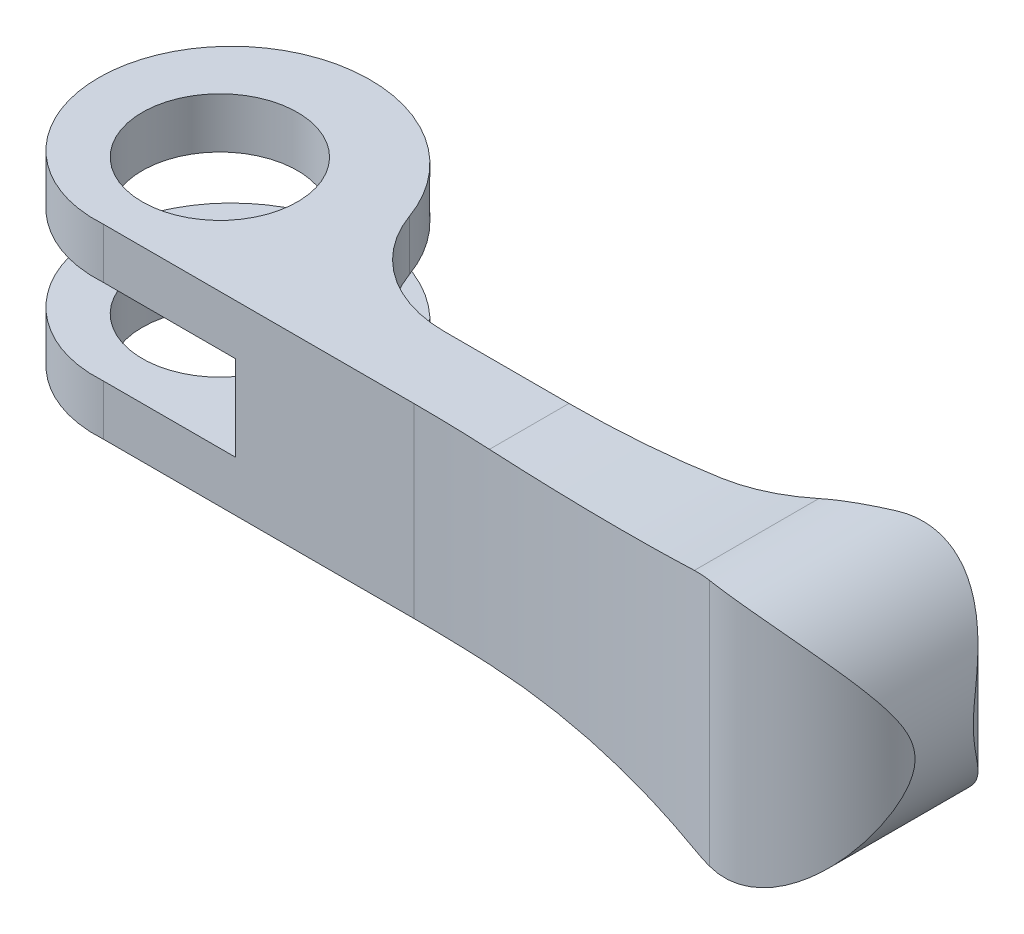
ISO-10303-21;
HEADER;
FILE_DESCRIPTION(('STEP AP214'),'2;1');
FILE_NAME('part.step','',(''),(''),'','','');
FILE_SCHEMA(('AUTOMOTIVE_DESIGN { 1 0 10303 214 1 1 1 1 }'));
ENDSEC;
DATA;
#1=APPLICATION_CONTEXT('core data for automotive mechanical design processes');
#2=APPLICATION_PROTOCOL_DEFINITION('international standard','automotive_design',2000,#1);
#3=PRODUCT_CONTEXT('',#1,'mechanical');
#4=PRODUCT('Part','Part','',(#3));
#5=PRODUCT_RELATED_PRODUCT_CATEGORY('part','',(#4));
#6=PRODUCT_DEFINITION_FORMATION('','',#4);
#7=PRODUCT_DEFINITION_CONTEXT('part definition',#1,'design');
#8=PRODUCT_DEFINITION('design','',#6,#7);
#9=PRODUCT_DEFINITION_SHAPE('','',#8);
#10=(LENGTH_UNIT() NAMED_UNIT(*) SI_UNIT(.MILLI.,.METRE.));
#11=(NAMED_UNIT(*) PLANE_ANGLE_UNIT() SI_UNIT($,.RADIAN.));
#12=(NAMED_UNIT(*) SI_UNIT($,.STERADIAN.) SOLID_ANGLE_UNIT());
#13=UNCERTAINTY_MEASURE_WITH_UNIT(LENGTH_MEASURE(1.E-05),#10,'distance_accuracy_value','');
#14=(GEOMETRIC_REPRESENTATION_CONTEXT(3) GLOBAL_UNCERTAINTY_ASSIGNED_CONTEXT((#13)) GLOBAL_UNIT_ASSIGNED_CONTEXT((#10,
#11,#12)) REPRESENTATION_CONTEXT('',''));
#15=CARTESIAN_POINT('',(0.,0.,0.));
#16=DIRECTION('',(0.,0.,1.));
#17=DIRECTION('',(1.,0.,0.));
#18=AXIS2_PLACEMENT_3D('',#15,#16,#17);
#19=CARTESIAN_POINT('',(46.0000000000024,-8.00000000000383,3.5000000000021));
#20=DIRECTION('',(0.,1.,0.));
#21=DIRECTION('',(1.,0.,0.));
#22=AXIS2_PLACEMENT_3D('',#19,#20,#21);
#23=CYLINDRICAL_SURFACE('',#22,4.5);
#24=DIRECTION('',(0.,1.,0.));
#25=VECTOR('',#24,1.);
#26=CARTESIAN_POINT('',(43.4276734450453,-8.00000000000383,-0.192307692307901));
#27=LINE('',#26,#25);
#28=CARTESIAN_POINT('',(43.4276734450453,-7.87157852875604,-0.192307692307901));
#29=VERTEX_POINT('',#28);
#30=CARTESIAN_POINT('',(43.4276734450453,7.87157852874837,-0.192307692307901));
#31=VERTEX_POINT('',#30);
#32=EDGE_CURVE('E306',#29,#31,#27,.T.);
#33=ORIENTED_EDGE('',*,*,#32,.T.);
#34=CARTESIAN_POINT('',(43.4276734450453,7.87157852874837,-0.192307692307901));
#35=CARTESIAN_POINT('',(43.523258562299,7.85425856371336,-0.258928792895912));
#36=CARTESIAN_POINT('',(43.6211842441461,7.83468392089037,-0.321607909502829));
#37=CARTESIAN_POINT('',(43.8207460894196,7.79071577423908,-0.438804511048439));
#38=CARTESIAN_POINT('',(43.9223816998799,7.76632298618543,-0.493323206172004));
#39=CARTESIAN_POINT('',(44.1279526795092,7.71252682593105,-0.59371219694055));
#40=CARTESIAN_POINT('',(44.2318754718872,7.68314677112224,-0.639620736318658));
#41=CARTESIAN_POINT('',(44.4414685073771,7.61913593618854,-0.722996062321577));
#42=CARTESIAN_POINT('',(44.547138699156,7.58450531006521,-0.760463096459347));
#43=CARTESIAN_POINT('',(44.7592373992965,7.5099430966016,-0.826992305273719));
#44=CARTESIAN_POINT('',(44.8656658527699,7.47001188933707,-0.856055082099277));
#45=CARTESIAN_POINT('',(45.0783878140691,7.3848938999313,-0.905970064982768));
#46=CARTESIAN_POINT('',(45.1846812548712,7.33970511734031,-0.926819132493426));
#47=CARTESIAN_POINT('',(45.3962371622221,7.24424197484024,-0.960599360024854));
#48=CARTESIAN_POINT('',(45.5014995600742,7.19396727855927,-0.973529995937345));
#49=CARTESIAN_POINT('',(45.7102658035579,7.08855491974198,-0.99188612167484));
#50=CARTESIAN_POINT('',(45.8137689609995,7.03341540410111,-0.997308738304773));
#51=CARTESIAN_POINT('',(46.0228790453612,6.91602811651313,-1.00120983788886));
#52=CARTESIAN_POINT('',(46.1283757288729,6.85357356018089,-0.999369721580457));
#53=CARTESIAN_POINT('',(46.3361454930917,6.72405069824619,-0.988634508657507));
#54=CARTESIAN_POINT('',(46.4384173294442,6.65698064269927,-0.979736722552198));
#55=CARTESIAN_POINT('',(46.7397120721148,6.44937990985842,-0.943391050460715));
#56=CARTESIAN_POINT('',(46.9332590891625,6.30243340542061,-0.906291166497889));
#57=CARTESIAN_POINT('',(47.2636061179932,6.02746951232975,-0.821561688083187));
#58=CARTESIAN_POINT('',(47.4037056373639,5.90209818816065,-0.777864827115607));
#59=CARTESIAN_POINT('',(47.6729193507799,5.64382658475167,-0.679935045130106));
#60=CARTESIAN_POINT('',(47.8020283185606,5.51092277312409,-0.625697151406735));
#61=CARTESIAN_POINT('',(48.1730975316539,5.10182618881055,-0.450019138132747));
#62=CARTESIAN_POINT('',(48.3982631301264,4.8157011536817,-0.315767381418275));
#63=CARTESIAN_POINT('',(48.7387591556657,4.31840281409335,-0.0745883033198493));
#64=CARTESIAN_POINT('',(48.8661331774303,4.11269079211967,0.0272560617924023));
#65=CARTESIAN_POINT('',(49.1011367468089,3.69213917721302,0.235408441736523));
#66=CARTESIAN_POINT('',(49.2087515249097,3.47729290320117,0.341719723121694));
#67=CARTESIAN_POINT('',(49.4043745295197,3.03857594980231,0.553645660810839));
#68=CARTESIAN_POINT('',(49.4923858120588,2.81470668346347,0.65926042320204));
#69=CARTESIAN_POINT('',(49.6486711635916,2.35717822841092,0.863029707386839));
#70=CARTESIAN_POINT('',(49.7169671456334,2.12353024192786,0.961192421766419));
#71=CARTESIAN_POINT('',(49.833073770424,1.64425791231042,1.14014631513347));
#72=CARTESIAN_POINT('',(49.8808886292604,1.39863604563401,1.22094106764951));
#73=CARTESIAN_POINT('',(49.9354550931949,1.02202264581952,1.31743586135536));
#74=CARTESIAN_POINT('',(49.950768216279,0.895435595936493,1.34544662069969));
#75=CARTESIAN_POINT('',(49.9753986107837,0.639885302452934,1.39123549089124));
#76=CARTESIAN_POINT('',(49.9847215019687,0.510924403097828,1.40902319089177));
#77=CARTESIAN_POINT('',(49.9939303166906,0.317973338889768,1.42670347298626));
#78=CARTESIAN_POINT('',(49.9962040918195,0.254483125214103,1.4310956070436));
#79=CARTESIAN_POINT('',(49.999239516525,0.127333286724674,1.4369700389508));
#80=CARTESIAN_POINT('',(50.0000011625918,0.0636736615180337,1.43845233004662));
#81=CARTESIAN_POINT('',(49.9999974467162,-0.139840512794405,1.43843589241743));
#82=CARTESIAN_POINT('',(49.9963156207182,-0.279748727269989,1.43125022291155));
#83=CARTESIAN_POINT('',(49.9817438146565,-0.557876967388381,1.40334852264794));
#84=CARTESIAN_POINT('',(49.9708462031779,-0.69609504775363,1.38261816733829));
#85=CARTESIAN_POINT('',(49.927740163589,-1.10784791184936,1.30307882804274));
#86=CARTESIAN_POINT('',(49.8851250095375,-1.37694580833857,1.2269603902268));
#87=CARTESIAN_POINT('',(49.7859735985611,-1.85091760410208,1.06616759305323));
#88=CARTESIAN_POINT('',(49.7335866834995,-2.05832238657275,0.985824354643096));
#89=CARTESIAN_POINT('',(49.6136585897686,-2.46517873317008,0.816292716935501));
#90=CARTESIAN_POINT('',(49.5461058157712,-2.66462407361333,0.727097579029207));
#91=CARTESIAN_POINT('',(49.3960507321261,-3.05656093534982,0.545209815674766));
#92=CARTESIAN_POINT('',(49.3135228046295,-3.24903985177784,0.452511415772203));
#93=CARTESIAN_POINT('',(49.1335608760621,-3.62713445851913,0.267750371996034));
#94=CARTESIAN_POINT('',(49.0361316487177,-3.81275232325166,0.175687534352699));
#95=CARTESIAN_POINT('',(48.8171048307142,-4.19275595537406,-0.0123361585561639));
#96=CARTESIAN_POINT('',(48.6941529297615,-4.38653401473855,-0.107957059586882));
#97=CARTESIAN_POINT('',(48.4298991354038,-4.76547436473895,-0.290967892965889));
#98=CARTESIAN_POINT('',(48.2885904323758,-4.95063342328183,-0.378354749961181));
#99=CARTESIAN_POINT('',(47.9879892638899,-5.31024333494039,-0.540664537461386));
#100=CARTESIAN_POINT('',(47.8287724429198,-5.48473475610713,-0.615636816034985));
#101=CARTESIAN_POINT('',(47.4920619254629,-5.82184339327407,-0.749293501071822));
#102=CARTESIAN_POINT('',(47.3145868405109,-5.98447241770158,-0.807994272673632));
#103=CARTESIAN_POINT('',(47.0247783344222,-6.22654739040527,-0.88307072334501));
#104=CARTESIAN_POINT('',(46.9183939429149,-6.31094254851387,-0.90667881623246));
#105=CARTESIAN_POINT('',(46.7005844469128,-6.47480165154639,-0.946507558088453));
#106=CARTESIAN_POINT('',(46.5891610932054,-6.5542672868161,-0.962730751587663));
#107=CARTESIAN_POINT('',(46.3617919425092,-6.70772501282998,-0.986888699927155));
#108=CARTESIAN_POINT('',(46.2458480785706,-6.781719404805,-0.994826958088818));
#109=CARTESIAN_POINT('',(46.0100790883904,-6.92374179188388,-1.00153348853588));
#110=CARTESIAN_POINT('',(45.8902538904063,-6.99176967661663,-1.00030159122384));
#111=CARTESIAN_POINT('',(45.6464744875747,-7.12197281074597,-0.98776720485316));
#112=CARTESIAN_POINT('',(45.5224917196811,-7.18408573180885,-0.97636832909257));
#113=CARTESIAN_POINT('',(45.2726750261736,-7.30127615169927,-0.94262134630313));
#114=CARTESIAN_POINT('',(45.1468409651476,-7.35635313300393,-0.92027243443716));
#115=CARTESIAN_POINT('',(44.8948384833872,-7.45911545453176,-0.864087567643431));
#116=CARTESIAN_POINT('',(44.7686704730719,-7.50680750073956,-0.830262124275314));
#117=CARTESIAN_POINT('',(44.5175191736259,-7.59472219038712,-0.750835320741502));
#118=CARTESIAN_POINT('',(44.3925354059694,-7.63494798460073,-0.705238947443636));
#119=CARTESIAN_POINT('',(44.1230974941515,-7.71463122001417,-0.592938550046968));
#120=CARTESIAN_POINT('',(43.9791700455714,-7.75265787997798,-0.523915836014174));
#121=CARTESIAN_POINT('',(43.7682524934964,-7.80246946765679,-0.408420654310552));
#122=CARTESIAN_POINT('',(43.6987652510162,-7.81787041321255,-0.367921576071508));
#123=CARTESIAN_POINT('',(43.5617079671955,-7.84639830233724,-0.28301862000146));
#124=CARTESIAN_POINT('',(43.4941384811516,-7.85952459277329,-0.238613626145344));
#125=CARTESIAN_POINT('',(43.4276734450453,-7.87157852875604,-0.192307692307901));
#126=B_SPLINE_CURVE_WITH_KNOTS('',3,(#34,#35,#36,#37,#38,#39,#40,#41,#42,#43,#44,#45,#46,#47,
#48,#49,#50,#51,#52,#53,#54,#55,#56,#57,#58,#59,#60,#61,#62,#63,#64,#65,#66,#67,#68,#69,#70,#71,
#72,#73,#74,#75,#76,#77,#78,#79,#80,#81,#82,#83,#84,#85,#86,#87,#88,#89,#90,#91,#92,#93,#94,#95,
#96,#97,#98,#99,#100,#101,#102,#103,#104,#105,#106,#107,#108,#109,#110,#111,#112,#113,#114,#115,
#116,#117,#118,#119,#120,#121,#122,#123,#124,#125),.UNSPECIFIED.,.F.,.F.,(4,2,2,2,2,2,2,2,2,2,2,
2,2,2,2,2,2,2,2,2,2,2,2,2,2,2,2,2,2,2,2,2,2,2,2,2,2,2,2,2,2,2,2,2,2,4),(0.,0.353268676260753,
0.706484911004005,1.05809305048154,1.40969087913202,1.76126351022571,2.11297035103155,
2.46470046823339,2.81656514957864,3.18403318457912,3.55164131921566,4.28670448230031,
4.865011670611,5.44359233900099,6.60288387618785,7.389636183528,8.17697419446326,
8.96418937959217,9.75052619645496,10.5367010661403,10.9279112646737,11.3187539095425,
11.5097263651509,11.7006992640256,12.1201151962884,12.5399754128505,13.3842166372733,
14.0690088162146,14.7543263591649,15.4408275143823,16.1271092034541,16.8720814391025,
17.617330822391,18.3595427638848,19.1010054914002,19.5141816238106,19.9272152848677,
20.3400742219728,20.7529407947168,21.1697635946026,21.5866170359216,22.0030896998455,
22.4193862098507,22.9103196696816,23.1558621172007,23.4014749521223),.UNSPECIFIED.);
#127=EDGE_CURVE('E252',#31,#29,#126,.T.);
#128=ORIENTED_EDGE('',*,*,#127,.T.);
#129=EDGE_LOOP('',(#33,#128));
#130=FACE_BOUND('',#129,.T.);
#131=ADVANCED_FACE('F14',(#130),#23,.T.);
#132=CARTESIAN_POINT('',(34.8532515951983,-8.00000000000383,-12.5));
#133=DIRECTION('',(0.,1.,0.));
#134=DIRECTION('',(1.,0.,0.));
#135=AXIS2_PLACEMENT_3D('',#132,#133,#134);
#136=CYLINDRICAL_SURFACE('',#135,15.);
#137=CARTESIAN_POINT('',(43.4276734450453,7.87157852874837,-0.192307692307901));
#138=CARTESIAN_POINT('',(43.2330964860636,7.90688424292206,-0.0567088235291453));
#139=CARTESIAN_POINT('',(43.0343618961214,7.93546031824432,0.0748476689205));
#140=CARTESIAN_POINT('',(42.6294150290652,7.97779975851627,0.329195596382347));
#141=CARTESIAN_POINT('',(42.4231916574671,7.99154013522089,0.451973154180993));
#142=CARTESIAN_POINT('',(42.0087624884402,8.00262854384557,0.685377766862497));
#143=CARTESIAN_POINT('',(41.8006722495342,8.00028859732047,0.796193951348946));
#144=CARTESIAN_POINT('',(41.3803562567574,7.97873783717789,1.00748429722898));
#145=CARTESIAN_POINT('',(41.1681347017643,7.95954335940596,1.10796836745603));
#146=CARTESIAN_POINT('',(40.8205226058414,7.91373229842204,1.26274941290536));
#147=CARTESIAN_POINT('',(40.6858632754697,7.89251801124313,1.32034222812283));
#148=CARTESIAN_POINT('',(40.4152492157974,7.84267986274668,1.43146636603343));
#149=CARTESIAN_POINT('',(40.2792916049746,7.81401139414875,1.48497063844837));
#150=CARTESIAN_POINT('',(40.1433447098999,7.78156996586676,1.5362001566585));
#151=B_SPLINE_CURVE_WITH_KNOTS('',3,(#137,#138,#139,#140,#141,#142,#143,#144,#145,#146,#147,
#148,#149,#150),.UNSPECIFIED.,.F.,.F.,(4,2,2,2,2,2,4),(0.,0.719320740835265,1.43975449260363,
2.14624901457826,2.85205953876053,3.29579458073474,3.74224871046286),.UNSPECIFIED.);
#152=CARTESIAN_POINT('',(40.1433447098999,7.78156996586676,1.5362001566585));
#153=VERTEX_POINT('',#152);
#154=EDGE_CURVE('E147',#31,#153,#151,.T.);
#155=ORIENTED_EDGE('',*,*,#154,.F.);
#156=ORIENTED_EDGE('',*,*,#32,.F.);
#157=CARTESIAN_POINT('',(43.4276734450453,-7.87157852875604,-0.192307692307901));
#158=CARTESIAN_POINT('',(43.2330964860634,-7.90688424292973,-0.0567088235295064));
#159=CARTESIAN_POINT('',(43.0343618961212,-7.93546031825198,0.0748476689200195));
#160=CARTESIAN_POINT('',(42.6294150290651,-7.97779975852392,0.329195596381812));
#161=CARTESIAN_POINT('',(42.423191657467,-7.99154013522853,0.451973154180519));
#162=CARTESIAN_POINT('',(42.00876248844,-8.00262854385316,0.685377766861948));
#163=CARTESIAN_POINT('',(41.8006722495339,-8.00028859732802,0.796193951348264));
#164=CARTESIAN_POINT('',(41.3803562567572,-7.97873783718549,1.00748429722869));
#165=CARTESIAN_POINT('',(41.1681347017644,-7.95954335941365,1.10796836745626));
#166=CARTESIAN_POINT('',(40.8205226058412,-7.91373229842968,1.26274941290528));
#167=CARTESIAN_POINT('',(40.6858632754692,-7.89251801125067,1.32034222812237));
#168=CARTESIAN_POINT('',(40.4152492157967,-7.842679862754,1.43146636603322));
#169=CARTESIAN_POINT('',(40.279291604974,-7.81401139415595,1.4849706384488));
#170=CARTESIAN_POINT('',(40.1433447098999,-7.78156996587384,1.5362001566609));
#171=B_SPLINE_CURVE_WITH_KNOTS('',3,(#157,#158,#159,#160,#161,#162,#163,#164,#165,#166,#167,
#168,#169,#170),.UNSPECIFIED.,.F.,.F.,(4,2,2,2,2,2,4),(0.,0.719320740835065,1.43975449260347,
2.14624901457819,2.85205953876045,3.29579458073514,3.74224871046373),.UNSPECIFIED.);
#172=CARTESIAN_POINT('',(40.1433447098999,-7.78156996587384,1.5362001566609));
#173=VERTEX_POINT('',#172);
#174=EDGE_CURVE('E224',#29,#173,#171,.T.);
#175=ORIENTED_EDGE('',*,*,#174,.T.);
#176=CARTESIAN_POINT('',(40.1433447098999,-7.78156996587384,1.5362001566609));
#177=CARTESIAN_POINT('',(39.7226989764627,-7.68115987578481,1.69478191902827));
#178=CARTESIAN_POINT('',(39.2943354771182,-7.58341808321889,1.83458508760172));
#179=CARTESIAN_POINT('',(38.4289272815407,-7.39532588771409,2.07443745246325));
#180=CARTESIAN_POINT('',(37.9919803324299,-7.30492227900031,2.17479786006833));
#181=CARTESIAN_POINT('',(37.1092559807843,-7.13189825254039,2.33616373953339));
#182=CARTESIAN_POINT('',(36.6634781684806,-7.04927819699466,2.39716738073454));
#183=CARTESIAN_POINT('',(35.9892167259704,-6.93163307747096,2.45864735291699));
#184=CARTESIAN_POINT('',(35.7625819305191,-6.89332037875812,2.47413735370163));
#185=CARTESIAN_POINT('',(35.3084550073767,-6.81901948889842,2.49481404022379));
#186=CARTESIAN_POINT('',(35.0809628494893,-6.78303138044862,2.50000035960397));
#187=CARTESIAN_POINT('',(34.8532515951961,-6.74824860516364,2.4999999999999));
#188=B_SPLINE_CURVE_WITH_KNOTS('',3,(#176,#177,#178,#179,#180,#181,#182,#183,#184,#185,#186,
#187),.UNSPECIFIED.,.F.,.F.,(4,2,2,2,2,4),(0.,1.38140175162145,2.75167395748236,
4.12200989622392,4.81291351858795,5.50384170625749),.UNSPECIFIED.);
#189=CARTESIAN_POINT('',(34.853251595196,-6.74824860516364,2.4999999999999));
#190=VERTEX_POINT('',#189);
#191=EDGE_CURVE('E326',#173,#190,#188,.T.);
#192=ORIENTED_EDGE('',*,*,#191,.T.);
#193=DIRECTION('',(0.,1.,0.));
#194=VECTOR('',#193,1.);
#195=CARTESIAN_POINT('',(34.853251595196,-8.00000000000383,2.4999999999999));
#196=LINE('',#195,#194);
#197=CARTESIAN_POINT('',(34.853251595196,6.74824860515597,2.4999999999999));
#198=VERTEX_POINT('',#197);
#199=EDGE_CURVE('E308',#190,#198,#196,.T.);
#200=ORIENTED_EDGE('',*,*,#199,.T.);
#201=CARTESIAN_POINT('',(40.1433447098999,7.78156996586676,1.5362001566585));
#202=CARTESIAN_POINT('',(39.7226989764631,7.68115987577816,1.69478191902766));
#203=CARTESIAN_POINT('',(39.2943354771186,7.58341808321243,1.83458508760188));
#204=CARTESIAN_POINT('',(38.428927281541,7.39532588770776,2.07443745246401));
#205=CARTESIAN_POINT('',(37.9919803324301,7.30492227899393,2.17479786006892));
#206=CARTESIAN_POINT('',(37.1092559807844,7.1318982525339,2.33616373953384));
#207=CARTESIAN_POINT('',(36.6634781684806,7.04927819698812,2.39716738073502));
#208=CARTESIAN_POINT('',(35.9892167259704,6.93163307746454,2.45864735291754));
#209=CARTESIAN_POINT('',(35.7625819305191,6.89332037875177,2.47413735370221));
#210=CARTESIAN_POINT('',(35.3084550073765,6.81901948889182,2.49481404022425));
#211=CARTESIAN_POINT('',(35.0809628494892,6.78303138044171,2.50000035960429));
#212=CARTESIAN_POINT('',(34.853251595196,6.74824860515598,2.4999999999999));
#213=B_SPLINE_CURVE_WITH_KNOTS('',3,(#201,#202,#203,#204,#205,#206,#207,#208,#209,#210,#211,
#212),.UNSPECIFIED.,.F.,.F.,(4,2,2,2,2,4),(0.,1.38140175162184,2.75167395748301,
4.12200989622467,4.81291351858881,5.50384170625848),.UNSPECIFIED.);
#214=EDGE_CURVE('E9',#153,#198,#213,.T.);
#215=ORIENTED_EDGE('',*,*,#214,.F.);
#216=EDGE_LOOP('',(#155,#156,#175,#192,#200,#215));
#217=FACE_BOUND('',#216,.T.);
#218=ADVANCED_FACE('F189',(#217),#136,.F.);
#219=CARTESIAN_POINT('',(43.,-8.00000000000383,2.4999999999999));
#220=DIRECTION('',(0.,1.,0.));
#221=DIRECTION('',(1.,0.,0.));
#222=AXIS2_PLACEMENT_3D('',#219,#220,#221);
#223=CYLINDRICAL_SURFACE('',#222,7.5);
#224=CARTESIAN_POINT('',(41.3886034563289,-7.97660292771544,9.82484820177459));
#225=CARTESIAN_POINT('',(41.5464586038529,-7.9887370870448,9.85961039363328));
#226=CARTESIAN_POINT('',(41.7058080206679,-7.99620387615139,9.88928122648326));
#227=CARTESIAN_POINT('',(42.0262332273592,-8.00155215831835,9.9382729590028));
#228=CARTESIAN_POINT('',(42.1873088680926,-7.99943447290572,9.95759474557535));
#229=CARTESIAN_POINT('',(42.5090864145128,-7.98540315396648,9.98565172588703));
#230=CARTESIAN_POINT('',(42.6697856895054,-7.97354213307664,9.99444315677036));
#231=CARTESIAN_POINT('',(42.9903910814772,-7.94009394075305,10.0017070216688));
#232=CARTESIAN_POINT('',(43.1502972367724,-7.91850724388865,10.0001799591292));
#233=CARTESIAN_POINT('',(43.4681029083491,-7.86578813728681,9.98706732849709));
#234=CARTESIAN_POINT('',(43.6260024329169,-7.83465576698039,9.9754818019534));
#235=CARTESIAN_POINT('',(43.9387484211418,-7.76318226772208,9.94268010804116));
#236=CARTESIAN_POINT('',(44.0935934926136,-7.72283704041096,9.92145965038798));
#237=CARTESIAN_POINT('',(44.3992999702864,-7.63339649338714,9.86993927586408));
#238=CARTESIAN_POINT('',(44.5501585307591,-7.58429510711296,9.83963305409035));
#239=CARTESIAN_POINT('',(44.8470052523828,-7.47792993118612,9.77061260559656));
#240=CARTESIAN_POINT('',(44.9929923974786,-7.42066445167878,9.7318966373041));
#241=CARTESIAN_POINT('',(45.3163229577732,-7.28287708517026,9.63581959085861));
#242=CARTESIAN_POINT('',(45.4920746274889,-7.20016176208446,9.57622410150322));
#243=CARTESIAN_POINT('',(45.8339806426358,-7.02407509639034,9.44636964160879));
#244=CARTESIAN_POINT('',(46.0001327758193,-6.93070131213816,9.37610822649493));
#245=CARTESIAN_POINT('',(46.4836095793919,-6.6362280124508,9.15136442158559));
#246=CARTESIAN_POINT('',(46.7859596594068,-6.42077436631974,8.98292091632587));
#247=CARTESIAN_POINT('',(47.2565228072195,-6.03564735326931,8.67923756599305));
#248=CARTESIAN_POINT('',(47.436297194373,-5.87399939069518,8.55111708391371));
#249=CARTESIAN_POINT('',(47.7773313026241,-5.53891153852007,8.28564978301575));
#250=CARTESIAN_POINT('',(47.9385829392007,-5.36546655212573,8.1482989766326));
#251=CARTESIAN_POINT('',(48.2435764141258,-5.00733419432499,7.86640175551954));
#252=CARTESIAN_POINT('',(48.3872263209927,-4.82259477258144,7.72182268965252));
#253=CARTESIAN_POINT('',(48.6565289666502,-4.4434965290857,7.42881616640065));
#254=CARTESIAN_POINT('',(48.7821889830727,-4.24914164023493,7.28039029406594));
#255=CARTESIAN_POINT('',(49.0200217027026,-3.8440064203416,6.97746394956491));
#256=CARTESIAN_POINT('',(49.1315797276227,-3.63289076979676,6.82293052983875));
#257=CARTESIAN_POINT('',(49.3363671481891,-3.19927679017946,6.51675174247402));
#258=CARTESIAN_POINT('',(49.4295684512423,-2.97676166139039,6.36511111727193));
#259=CARTESIAN_POINT('',(49.5549257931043,-2.63395314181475,6.14555038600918));
#260=CARTESIAN_POINT('',(49.5941899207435,-2.51860338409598,6.07392086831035));
#261=CARTESIAN_POINT('',(49.6679673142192,-2.28416212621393,5.93430183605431));
#262=CARTESIAN_POINT('',(49.7024792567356,-2.16506959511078,5.86631333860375));
#263=CARTESIAN_POINT('',(49.7664416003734,-1.92302135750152,5.7358204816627));
#264=CARTESIAN_POINT('',(49.795905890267,-1.80007738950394,5.6733013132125));
#265=CARTESIAN_POINT('',(49.8495380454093,-1.54956200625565,5.55581257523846));
#266=CARTESIAN_POINT('',(49.8737101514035,-1.42199439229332,5.50083697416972));
#267=CARTESIAN_POINT('',(49.9118149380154,-1.18912892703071,5.41181231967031));
#268=CARTESIAN_POINT('',(49.9268318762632,-1.08476970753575,5.37579239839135));
#269=CARTESIAN_POINT('',(49.9529369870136,-0.873020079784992,5.312090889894));
#270=CARTESIAN_POINT('',(49.9640256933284,-0.765630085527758,5.28440816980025));
#271=CARTESIAN_POINT('',(49.9818566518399,-0.549222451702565,5.2393917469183));
#272=CARTESIAN_POINT('',(49.9886337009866,-0.440225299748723,5.2219752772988));
#273=CARTESIAN_POINT('',(49.9977048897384,-0.220818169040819,5.19857200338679));
#274=CARTESIAN_POINT('',(50.0000001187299,-0.110408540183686,5.19258242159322));
#275=CARTESIAN_POINT('',(49.9999998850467,0.106901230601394,5.19258238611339));
#276=CARTESIAN_POINT('',(49.9978479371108,0.213801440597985,5.19819743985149));
#277=CARTESIAN_POINT('',(49.9893428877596,0.426299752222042,5.2201503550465));
#278=CARTESIAN_POINT('',(49.9829890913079,0.531897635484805,5.23648999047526));
#279=CARTESIAN_POINT('',(49.9578594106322,0.846700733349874,5.30004972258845));
#280=CARTESIAN_POINT('',(49.9330199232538,1.05252276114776,5.36178497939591));
#281=CARTESIAN_POINT('',(49.876212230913,1.41116775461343,5.49529620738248));
#282=CARTESIAN_POINT('',(49.8467203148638,1.56625794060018,5.56247854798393));
#283=CARTESIAN_POINT('',(49.7799827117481,1.86975027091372,5.70752660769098));
#284=CARTESIAN_POINT('',(49.7427306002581,2.01814674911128,5.78540116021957));
#285=CARTESIAN_POINT('',(49.6609534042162,2.30926809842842,5.94819038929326));
#286=CARTESIAN_POINT('',(49.6164142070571,2.45198128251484,6.0331185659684));
#287=CARTESIAN_POINT('',(49.5203908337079,2.73233479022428,6.20734780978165));
#288=CARTESIAN_POINT('',(49.4689045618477,2.86997356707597,6.29665019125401));
#289=CARTESIAN_POINT('',(49.3138843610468,3.25242525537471,6.55241465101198));
#290=CARTESIAN_POINT('',(49.2024221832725,3.49209229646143,6.72181984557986));
#291=CARTESIAN_POINT('',(48.9568202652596,3.95880383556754,7.06184814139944));
#292=CARTESIAN_POINT('',(48.8226650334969,4.18583956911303,7.23247199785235));
#293=CARTESIAN_POINT('',(48.5314395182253,4.62709931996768,7.56978845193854));
#294=CARTESIAN_POINT('',(48.3744082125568,4.84134427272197,7.73648718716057));
#295=CARTESIAN_POINT('',(48.0366323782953,5.25648081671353,8.06213466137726));
#296=CARTESIAN_POINT('',(47.8559031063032,5.45738087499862,8.22108829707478));
#297=CARTESIAN_POINT('',(47.5308514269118,5.78313662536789,8.47911886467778));
#298=CARTESIAN_POINT('',(47.3929884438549,5.912015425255,8.58128752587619));
#299=CARTESIAN_POINT('',(47.1056221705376,6.16188929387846,8.7788749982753));
#300=CARTESIAN_POINT('',(46.9561159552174,6.2828823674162,8.87429210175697));
#301=CARTESIAN_POINT('',(46.6456928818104,6.51576080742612,9.05677523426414));
#302=CARTESIAN_POINT('',(46.4847903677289,6.62765725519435,9.14385144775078));
#303=CARTESIAN_POINT('',(46.1516925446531,6.84123887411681,9.30817793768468));
#304=CARTESIAN_POINT('',(45.9795043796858,6.94293040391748,9.3854343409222));
#305=CARTESIAN_POINT('',(45.6579901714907,7.11659094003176,9.51492435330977));
#306=CARTESIAN_POINT('',(45.5105227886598,7.19053898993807,9.56912470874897));
#307=CARTESIAN_POINT('',(45.2089840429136,7.33007490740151,9.66907234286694));
#308=CARTESIAN_POINT('',(45.0549159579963,7.3956668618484,9.71482375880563));
#309=CARTESIAN_POINT('',(44.740759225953,7.51775491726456,9.79699383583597));
#310=CARTESIAN_POINT('',(44.580669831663,7.57424988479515,9.83341133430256));
#311=CARTESIAN_POINT('',(44.2553872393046,7.67739107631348,9.89604148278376));
#312=CARTESIAN_POINT('',(44.0901941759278,7.72403755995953,9.92225440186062));
#313=CARTESIAN_POINT('',(43.7546289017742,7.80713551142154,9.96386763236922));
#314=CARTESIAN_POINT('',(43.5842279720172,7.8435111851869,9.97918876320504));
#315=CARTESIAN_POINT('',(43.2407416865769,7.90512515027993,9.99810822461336));
#316=CARTESIAN_POINT('',(43.067655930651,7.93036176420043,10.0017047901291));
#317=CARTESIAN_POINT('',(42.7206507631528,7.9693853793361,9.99680133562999));
#318=CARTESIAN_POINT('',(42.5467331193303,7.98319055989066,9.9883205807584));
#319=CARTESIAN_POINT('',(42.1994736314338,7.99939920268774,9.95918765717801));
#320=CARTESIAN_POINT('',(42.0261314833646,8.00181017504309,9.93854351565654));
#321=CARTESIAN_POINT('',(41.7757439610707,7.99723894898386,9.89982852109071));
#322=CARTESIAN_POINT('',(41.697833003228,7.99466931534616,9.88651481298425));
#323=CARTESIAN_POINT('',(41.5427044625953,7.9872960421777,9.85747944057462));
#324=CARTESIAN_POINT('',(41.465485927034,7.9824962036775,9.84176190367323));
#325=CARTESIAN_POINT('',(41.3886034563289,7.97660292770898,9.82484820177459));
#326=B_SPLINE_CURVE_WITH_KNOTS('',3,(#224,#225,#226,#227,#228,#229,#230,#231,#232,#233,#234,
#235,#236,#237,#238,#239,#240,#241,#242,#243,#244,#245,#246,#247,#248,#249,#250,#251,#252,#253,
#254,#255,#256,#257,#258,#259,#260,#261,#262,#263,#264,#265,#266,#267,#268,#269,#270,#271,#272,
#273,#274,#275,#276,#277,#278,#279,#280,#281,#282,#283,#284,#285,#286,#287,#288,#289,#290,#291,
#292,#293,#294,#295,#296,#297,#298,#299,#300,#301,#302,#303,#304,#305,#306,#307,#308,#309,#310,
#311,#312,#313,#314,#315,#316,#317,#318,#319,#320,#321,#322,#323,#324,#325),.UNSPECIFIED.,.F.,
.F.,(4,2,2,2,2,2,2,2,2,2,2,2,2,2,2,2,2,2,2,2,2,2,2,2,2,2,2,2,2,2,2,2,2,2,2,2,2,2,2,2,2,2,2,2,2,
2,2,2,2,2,4),(0.,0.486146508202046,0.972251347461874,1.45574841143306,1.93922188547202,
2.42269336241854,2.90638033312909,3.39040372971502,3.87452745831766,4.48315961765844,
5.09193148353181,6.30945839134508,7.12940091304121,7.94969996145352,8.774115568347,
9.59819671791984,10.4507011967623,11.3045003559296,11.7283978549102,12.1524131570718,
12.5752423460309,12.9977314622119,13.3316390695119,13.6655012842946,13.9966337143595,
14.3276856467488,14.648221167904,14.9688097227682,15.6140851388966,16.1281617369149,
16.6426656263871,17.1581779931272,17.6738462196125,18.6144420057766,19.5556825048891,
20.4953376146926,21.4343907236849,22.0777060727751,22.7211835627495,23.3638650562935,
24.0061435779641,24.5265935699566,25.0467880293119,25.567047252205,26.0872927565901,
26.6112826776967,27.1353514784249,27.6585852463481,28.1814740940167,28.4186611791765,
28.6554454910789),.UNSPECIFIED.);
#327=CARTESIAN_POINT('',(41.3886034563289,-7.97660292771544,9.82484820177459));
#328=VERTEX_POINT('',#327);
#329=CARTESIAN_POINT('',(41.3886034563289,7.97660292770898,9.82484820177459));
#330=VERTEX_POINT('',#329);
#331=EDGE_CURVE('E213',#328,#330,#326,.T.);
#332=ORIENTED_EDGE('',*,*,#331,.T.);
#333=DIRECTION('',(0.,1.,0.));
#334=VECTOR('',#333,1.);
#335=CARTESIAN_POINT('',(41.3886034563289,-8.00000000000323,9.82484820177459));
#336=LINE('',#335,#334);
#337=EDGE_CURVE('E300',#328,#330,#336,.T.);
#338=ORIENTED_EDGE('',*,*,#337,.F.);
#339=EDGE_LOOP('',(#332,#338));
#340=FACE_BOUND('',#339,.T.);
#341=ADVANCED_FACE('F230',(#340),#223,.T.);
#342=CARTESIAN_POINT('',(42.0000000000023,-4.29691004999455E-12,-12.5));
#343=DIRECTION('',(0.,0.,1.));
#344=DIRECTION('',(-1.,0.,0.));
#345=AXIS2_PLACEMENT_3D('',#342,#343,#344);
#346=CYLINDRICAL_SURFACE('',#345,8.);
#347=ORIENTED_EDGE('',*,*,#127,.F.);
#348=ORIENTED_EDGE('',*,*,#154,.T.);
#349=DIRECTION('',(0.,0.,1.));
#350=VECTOR('',#349,1.);
#351=CARTESIAN_POINT('',(40.1433447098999,7.78156996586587,-12.5));
#352=LINE('',#351,#350);
#353=CARTESIAN_POINT('',(40.1433447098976,7.78156996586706,9.5592406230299));
#354=VERTEX_POINT('',#353);
#355=EDGE_CURVE('E156',#153,#354,#352,.T.);
#356=ORIENTED_EDGE('',*,*,#355,.T.);
#357=CARTESIAN_POINT('',(40.1433447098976,7.78156996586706,9.5592406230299));
#358=CARTESIAN_POINT('',(40.2458941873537,7.80603937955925,9.58042855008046));
#359=CARTESIAN_POINT('',(40.348871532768,7.82846573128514,9.60187471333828));
#360=CARTESIAN_POINT('',(40.5553761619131,7.86918752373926,9.64522558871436));
#361=CARTESIAN_POINT('',(40.6589023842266,7.8874891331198,9.66712956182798));
#362=CARTESIAN_POINT('',(40.9704289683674,7.93625939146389,9.73356333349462));
#363=CARTESIAN_POINT('',(41.1792613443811,7.96056586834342,9.77879105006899));
#364=CARTESIAN_POINT('',(41.3886034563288,7.97660292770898,9.82484820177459));
#365=B_SPLINE_CURVE_WITH_KNOTS('',3,(#357,#358,#359,#360,#361,#362,#363,#364),.UNSPECIFIED.,.F.,
.F.,(4,2,2,4),(0.,0.322577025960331,0.64466838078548,1.28921460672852),.UNSPECIFIED.);
#366=EDGE_CURVE('E178',#354,#330,#365,.T.);
#367=ORIENTED_EDGE('',*,*,#366,.T.);
#368=ORIENTED_EDGE('',*,*,#331,.F.);
#369=CARTESIAN_POINT('',(40.1433447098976,-7.78156996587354,9.55924062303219));
#370=CARTESIAN_POINT('',(40.2458941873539,-7.80603937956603,9.58042855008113));
#371=CARTESIAN_POINT('',(40.3488715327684,-7.82846573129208,9.60187471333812));
#372=CARTESIAN_POINT('',(40.5553761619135,-7.86918752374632,9.64522558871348));
#373=CARTESIAN_POINT('',(40.658902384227,-7.88748913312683,9.66712956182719));
#374=CARTESIAN_POINT('',(40.9704289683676,-7.93625939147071,9.73356333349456));
#375=CARTESIAN_POINT('',(41.179261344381,-7.96056586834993,9.77879105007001));
#376=CARTESIAN_POINT('',(41.3886034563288,-7.97660292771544,9.8248482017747));
#377=B_SPLINE_CURVE_WITH_KNOTS('',3,(#369,#370,#371,#372,#373,#374,#375,#376),.UNSPECIFIED.,.F.,
.F.,(4,2,2,4),(0.,0.322577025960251,0.644668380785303,1.28921460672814),.UNSPECIFIED.);
#378=CARTESIAN_POINT('',(40.1433447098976,-7.78156996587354,9.55924062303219));
#379=VERTEX_POINT('',#378);
#380=EDGE_CURVE('E223',#379,#328,#377,.T.);
#381=ORIENTED_EDGE('',*,*,#380,.F.);
#382=DIRECTION('',(0.,0.,1.));
#383=VECTOR('',#382,1.);
#384=CARTESIAN_POINT('',(40.1433447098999,-7.78156996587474,-12.4999999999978));
#385=LINE('',#384,#383);
#386=EDGE_CURVE('E209',#173,#379,#385,.T.);
#387=ORIENTED_EDGE('',*,*,#386,.F.);
#388=ORIENTED_EDGE('',*,*,#174,.F.);
#389=EDGE_LOOP('',(#347,#348,#356,#367,#368,#381,#387,#388));
#390=FACE_BOUND('',#389,.T.);
#391=ADVANCED_FACE('F200',(#390),#346,.T.);
#392=CARTESIAN_POINT('',(8.50000000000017,-2.75000000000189,50.));
#393=DIRECTION('',(1.,0.,0.));
#394=DIRECTION('',(0.,0.,1.));
#395=AXIS2_PLACEMENT_3D('',#392,#393,#394);
#396=PLANE('',#395);
#397=DIRECTION('',(0.,0.,-1.));
#398=VECTOR('',#397,1.);
#399=CARTESIAN_POINT('',(8.50000000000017,2.74999999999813,50.));
#400=LINE('',#399,#398);
#401=CARTESIAN_POINT('',(8.5,2.74999999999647,7.4999999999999));
#402=VERTEX_POINT('',#401);
#403=CARTESIAN_POINT('',(8.5,2.74999999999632,2.4999999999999));
#404=VERTEX_POINT('',#403);
#405=EDGE_CURVE('E347',#402,#404,#400,.T.);
#406=ORIENTED_EDGE('',*,*,#405,.T.);
#407=DIRECTION('',(0.,1.,0.));
#408=VECTOR('',#407,1.);
#409=CARTESIAN_POINT('',(8.5,-2.75000000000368,2.4999999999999));
#410=LINE('',#409,#408);
#411=CARTESIAN_POINT('',(8.5,-2.75000000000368,2.4999999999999));
#412=VERTEX_POINT('',#411);
#413=EDGE_CURVE('E343',#412,#404,#410,.T.);
#414=ORIENTED_EDGE('',*,*,#413,.F.);
#415=DIRECTION('',(0.,0.,-1.));
#416=VECTOR('',#415,1.);
#417=CARTESIAN_POINT('',(8.50000000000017,-2.75000000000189,50.));
#418=LINE('',#417,#416);
#419=CARTESIAN_POINT('',(8.5,-2.75000000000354,7.4999999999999));
#420=VERTEX_POINT('',#419);
#421=EDGE_CURVE('E352',#420,#412,#418,.T.);
#422=ORIENTED_EDGE('',*,*,#421,.F.);
#423=DIRECTION('',(0.,-1.,0.));
#424=VECTOR('',#423,1.);
#425=CARTESIAN_POINT('',(8.5000000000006,-8.00000000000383,7.4999999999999));
#426=LINE('',#425,#424);
#427=EDGE_CURVE('E298',#402,#420,#426,.T.);
#428=ORIENTED_EDGE('',*,*,#427,.F.);
#429=EDGE_LOOP('',(#406,#414,#422,#428));
#430=FACE_BOUND('',#429,.T.);
#431=ADVANCED_FACE('F237',(#430),#396,.F.);
#432=CARTESIAN_POINT('',(24.9999999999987,-71.2500000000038,-12.5));
#433=DIRECTION('',(0.,0.,1.));
#434=DIRECTION('',(-1.,0.,0.));
#435=AXIS2_PLACEMENT_3D('',#432,#433,#434);
#436=CYLINDRICAL_SURFACE('',#435,65.25);
#437=DIRECTION('',(0.,0.,1.));
#438=VECTOR('',#437,1.);
#439=CARTESIAN_POINT('',(24.9999999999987,-6.00000000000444,-12.5));
#440=LINE('',#439,#438);
#441=CARTESIAN_POINT('',(25.,-6.00000000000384,2.4999999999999));
#442=VERTEX_POINT('',#441);
#443=CARTESIAN_POINT('',(25.,-6.00000000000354,7.62564433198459));
#444=VERTEX_POINT('',#443);
#445=EDGE_CURVE('E210',#442,#444,#440,.T.);
#446=ORIENTED_EDGE('',*,*,#445,.F.);
#447=CARTESIAN_POINT('',(25.,-71.2500000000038,2.4999999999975));
#448=DIRECTION('',(0.,0.,1.));
#449=DIRECTION('',(-1.,0.,0.));
#450=AXIS2_PLACEMENT_3D('',#447,#448,#449);
#451=CIRCLE('',#450,65.25);
#452=EDGE_CURVE('E259',#190,#442,#451,.T.);
#453=ORIENTED_EDGE('',*,*,#452,.F.);
#454=ORIENTED_EDGE('',*,*,#191,.F.);
#455=ORIENTED_EDGE('',*,*,#386,.T.);
#456=CARTESIAN_POINT('',(25.,-6.00000000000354,7.62564433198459));
#457=CARTESIAN_POINT('',(25.6432150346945,-5.99999671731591,7.65798661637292));
#458=CARTESIAN_POINT('',(26.2860644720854,-6.00951199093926,7.69657845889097));
#459=CARTESIAN_POINT('',(27.5703265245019,-6.04748034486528,7.78617549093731));
#460=CARTESIAN_POINT('',(28.2117391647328,-6.0759330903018,7.83718046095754));
#461=CARTESIAN_POINT('',(30.1265504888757,-6.18917961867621,8.00813073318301));
#462=CARTESIAN_POINT('',(31.3968109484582,-6.30186449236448,8.14632916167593));
#463=CARTESIAN_POINT('',(33.922508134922,-6.60041769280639,8.47014726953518));
#464=CARTESIAN_POINT('',(35.1779454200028,-6.78628325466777,8.65576515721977));
#465=CARTESIAN_POINT('',(37.0486962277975,-7.11891974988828,8.96867057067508));
#466=CARTESIAN_POINT('',(37.6717158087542,-7.23913092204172,9.07903027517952));
#467=CARTESIAN_POINT('',(38.9119872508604,-7.49719375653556,9.31087118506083));
#468=CARTESIAN_POINT('',(39.5292392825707,-7.63504489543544,9.43235206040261));
#469=CARTESIAN_POINT('',(40.1433447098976,-7.78156996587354,9.5592406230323));
#470=B_SPLINE_CURVE_WITH_KNOTS('',3,(#456,#457,#458,#459,#460,#461,#462,#463,#464,#465,#466,
#467,#468,#469),.UNSPECIFIED.,.F.,.F.,(4,2,2,2,2,2,4),(0.,1.93188145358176,3.8637287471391,
7.70857673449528,11.5532794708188,13.4850725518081,15.4168083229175),.UNSPECIFIED.);
#471=EDGE_CURVE('E399',#444,#379,#470,.T.);
#472=ORIENTED_EDGE('',*,*,#471,.F.);
#473=EDGE_LOOP('',(#446,#453,#454,#455,#472));
#474=FACE_BOUND('',#473,.T.);
#475=ADVANCED_FACE('F239',(#474),#436,.F.);
#476=CARTESIAN_POINT('',(16.9421671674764,-4.03670152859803E-12,-5.5000000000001));
#477=DIRECTION('',(0.,1.,0.));
#478=DIRECTION('',(1.,0.,0.));
#479=AXIS2_PLACEMENT_3D('',#476,#477,#478);
#480=CYLINDRICAL_SURFACE('',#479,8.);
#481=DIRECTION('',(0.,-1.,0.));
#482=VECTOR('',#481,1.);
#483=CARTESIAN_POINT('',(16.9421671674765,7.99999999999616,2.4999999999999));
#484=LINE('',#483,#482);
#485=CARTESIAN_POINT('',(16.9421671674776,-6.00000000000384,2.4999999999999));
#486=VERTEX_POINT('',#485);
#487=CARTESIAN_POINT('',(16.9421671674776,-2.75000000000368,2.4999999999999));
#488=VERTEX_POINT('',#487);
#489=EDGE_CURVE('E316',#486,#488,#484,.F.);
#490=ORIENTED_EDGE('',*,*,#489,.F.);
#491=CARTESIAN_POINT('',(16.9421671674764,-6.00000000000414,-5.4999999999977));
#492=DIRECTION('',(0.,1.,0.));
#493=DIRECTION('',(1.,0.,0.));
#494=AXIS2_PLACEMENT_3D('',#491,#492,#493);
#495=CIRCLE('',#494,8.);
#496=CARTESIAN_POINT('',(9.40828544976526,-6.00000000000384,-2.8091588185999));
#497=VERTEX_POINT('',#496);
#498=EDGE_CURVE('E400',#486,#497,#495,.F.);
#499=ORIENTED_EDGE('',*,*,#498,.T.);
#500=DIRECTION('',(0.,1.,0.));
#501=VECTOR('',#500,1.);
#502=CARTESIAN_POINT('',(9.40828544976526,7.99999999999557,-2.8091588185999));
#503=LINE('',#502,#501);
#504=CARTESIAN_POINT('',(9.40828544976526,-2.75000000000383,-2.8091588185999));
#505=VERTEX_POINT('',#504);
#506=EDGE_CURVE('E318',#505,#497,#503,.F.);
#507=ORIENTED_EDGE('',*,*,#506,.F.);
#508=CARTESIAN_POINT('',(16.9421671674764,-2.75000000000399,-5.5000000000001));
#509=DIRECTION('',(0.,-1.,0.));
#510=DIRECTION('',(-1.,0.,0.));
#511=AXIS2_PLACEMENT_3D('',#508,#509,#510);
#512=CIRCLE('',#511,8.);
#513=EDGE_CURVE('E323',#505,#488,#512,.F.);
#514=ORIENTED_EDGE('',*,*,#513,.T.);
#515=EDGE_LOOP('',(#490,#499,#507,#514));
#516=FACE_BOUND('',#515,.T.);
#517=ADVANCED_FACE('F289',(#516),#480,.F.);
#518=CARTESIAN_POINT('',(0.,-8.00000000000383,7.4999999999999));
#519=CARTESIAN_POINT('',(-0.981747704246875,-8.00000000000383,7.5686458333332));
#520=CARTESIAN_POINT('',(-1.99074321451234,-8.00000000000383,7.4419520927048));
#521=CARTESIAN_POINT('',(-3.9071260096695,-8.00000000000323,6.7967637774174));
#522=CARTESIAN_POINT('',(-4.81367689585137,-8.00000000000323,6.2783241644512));
#523=CARTESIAN_POINT('',(-6.37540403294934,-8.00000000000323,4.91075676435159));
#524=CARTESIAN_POINT('',(-7.02981358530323,-8.00000000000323,4.0620148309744));
#525=CARTESIAN_POINT('',(-7.96994804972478,-8.00000000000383,2.1510898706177));
#526=CARTESIAN_POINT('',(-8.25510416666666,-8.00000000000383,1.08957632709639));
#527=CARTESIAN_POINT('',(-8.39239583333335,-8.00000000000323,-1.0895763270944));
#528=CARTESIAN_POINT('',(-8.24426208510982,-8.00000000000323,-2.20635803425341));
#529=CARTESIAN_POINT('',(-7.51654531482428,-8.00000000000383,-4.3219821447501));
#530=CARTESIAN_POINT('',(-6.93704972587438,-8.00000000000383,-5.31990975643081));
#531=CARTESIAN_POINT('',(-5.41698962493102,-8.00000000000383,-7.0341295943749));
#532=CARTESIAN_POINT('',(-4.47687096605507,-8.00000000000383,-7.74959512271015));
#533=CARTESIAN_POINT('',(-2.3667046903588,-8.00000000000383,-8.77225804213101));
#534=CARTESIAN_POINT('',(-1.19740494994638,-8.00000000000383,-9.0788541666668));
#535=CARTESIAN_POINT('',(1.19740494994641,-8.00000000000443,-9.21614583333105));
#536=CARTESIAN_POINT('',(2.42197285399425,-8.00000000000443,-9.046572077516));
#537=CARTESIAN_POINT('',(4.73683827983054,-8.00000000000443,-8.2363268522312));
#538=CARTESIAN_POINT('',(5.82614261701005,-8.00000000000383,-7.59577528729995));
#539=CARTESIAN_POINT('',(7.69285515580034,-8.00000000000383,-5.92322248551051));
#540=CARTESIAN_POINT('',(8.46937666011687,-8.00000000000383,-4.8917271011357));
#541=CARTESIAN_POINT('',(9.57456803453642,-8.00000000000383,-2.58231951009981));
#542=CARTESIAN_POINT('',(9.90260416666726,-8.00000000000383,-1.3052335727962));
#543=CARTESIAN_POINT('',(10.0398958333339,-8.00000000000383,1.3052335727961));
#544=CARTESIAN_POINT('',(9.84888206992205,-8.00000000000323,2.6375876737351));
#545=CARTESIAN_POINT('',(8.95610838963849,-8.00000000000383,5.15169441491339));
#546=CARTESIAN_POINT('',(8.25450084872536,-8.00000000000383,6.3323754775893));
#547=CARTESIAN_POINT('',(6.42945534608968,-8.00000000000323,8.3515807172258));
#548=CARTESIAN_POINT('',(5.30658323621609,-8.00000000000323,9.18915819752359));
#549=CARTESIAN_POINT('',(2.79793432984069,-8.00000000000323,10.3768780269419));
#550=CARTESIAN_POINT('',(1.41306219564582,-8.00000000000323,10.7263541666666));
#551=CARTESIAN_POINT('',(0.,-8.00000000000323,10.795));
#552=B_SPLINE_CURVE_WITH_KNOTS('',3,(#518,#519,#520,#521,#522,#523,#524,#525,#526,#527,#528,
#529,#530,#531,#532,#533,#534,#535,#536,#537,#538,#539,#540,#541,#542,#543,#544,#545,#546,#547,
#548,#549,#550,#551),.UNSPECIFIED.,.F.,.F.,(4,2,2,2,2,2,2,2,2,2,2,2,2,2,2,2,4),(0.,0.0625,0.125,
0.1875,0.25,0.3125,0.375,0.4375,0.5,0.5625,0.625,0.6875,0.75,0.8125,0.875,0.9375,1.),.UNSPECIFIED.);
#553=DIRECTION('',(0.,1.,0.));
#554=VECTOR('',#553,1.);
#555=SURFACE_OF_LINEAR_EXTRUSION('',#552,#554);
#556=ORIENTED_EDGE('',*,*,#506,.T.);
#557=CARTESIAN_POINT('',(0.,-6.00000000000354,7.4999999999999));
#558=CARTESIAN_POINT('',(-0.981747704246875,-6.00000000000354,7.5686458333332));
#559=CARTESIAN_POINT('',(-1.99074321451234,-6.00000000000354,7.4419520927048));
#560=CARTESIAN_POINT('',(-3.9071260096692,-6.00000000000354,6.7967637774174));
#561=CARTESIAN_POINT('',(-4.81367689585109,-6.00000000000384,6.2783241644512));
#562=CARTESIAN_POINT('',(-6.37540403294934,-6.00000000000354,4.91075676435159));
#563=CARTESIAN_POINT('',(-7.02981358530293,-6.00000000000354,4.0620148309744));
#564=CARTESIAN_POINT('',(-7.96994804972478,-6.00000000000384,2.1510898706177));
#565=CARTESIAN_POINT('',(-8.25510416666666,-6.00000000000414,1.08957632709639));
#566=CARTESIAN_POINT('',(-8.39239583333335,-6.00000000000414,-1.08957632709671));
#567=CARTESIAN_POINT('',(-8.24426208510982,-6.00000000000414,-2.20635803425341));
#568=CARTESIAN_POINT('',(-7.51654531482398,-6.00000000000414,-4.3219821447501));
#569=CARTESIAN_POINT('',(-6.93704972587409,-6.00000000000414,-5.31990975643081));
#570=CARTESIAN_POINT('',(-5.41698962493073,-6.00000000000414,-7.0341295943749));
#571=CARTESIAN_POINT('',(-4.47687096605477,-6.00000000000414,-7.74959512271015));
#572=CARTESIAN_POINT('',(-2.3667046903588,-6.00000000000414,-8.77225804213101));
#573=CARTESIAN_POINT('',(-1.19740494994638,-6.00000000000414,-9.0788541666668));
#574=CARTESIAN_POINT('',(1.19740494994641,-6.00000000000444,-9.21614583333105));
#575=CARTESIAN_POINT('',(2.42197285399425,-6.00000000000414,-9.046572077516));
#576=CARTESIAN_POINT('',(4.73683827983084,-6.00000000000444,-8.2363268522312));
#577=CARTESIAN_POINT('',(5.82614261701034,-6.00000000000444,-7.59577528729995));
#578=CARTESIAN_POINT('',(7.69285515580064,-6.00000000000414,-5.92322248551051));
#579=CARTESIAN_POINT('',(8.46937666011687,-6.00000000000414,-4.8917271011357));
#580=CARTESIAN_POINT('',(9.57456803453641,-6.00000000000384,-2.58231951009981));
#581=CARTESIAN_POINT('',(9.90260416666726,-6.00000000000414,-1.3052335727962));
#582=CARTESIAN_POINT('',(10.0398958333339,-6.00000000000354,1.3052335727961));
#583=CARTESIAN_POINT('',(9.84888206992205,-6.00000000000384,2.6375876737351));
#584=CARTESIAN_POINT('',(8.95610838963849,-6.00000000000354,5.15169441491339));
#585=CARTESIAN_POINT('',(8.25450084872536,-6.00000000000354,6.3323754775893));
#586=CARTESIAN_POINT('',(6.42945534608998,-6.00000000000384,8.3515807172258));
#587=CARTESIAN_POINT('',(5.30658323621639,-6.00000000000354,9.18915819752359));
#588=CARTESIAN_POINT('',(2.79793432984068,-6.00000000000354,10.3768780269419));
#589=CARTESIAN_POINT('',(1.41306219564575,-6.00000000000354,10.7263541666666));
#590=CARTESIAN_POINT('',(0.,-6.00000000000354,10.795));
#591=B_SPLINE_CURVE_WITH_KNOTS('',3,(#557,#558,#559,#560,#561,#562,#563,#564,#565,#566,#567,
#568,#569,#570,#571,#572,#573,#574,#575,#576,#577,#578,#579,#580,#581,#582,#583,#584,#585,#586,
#587,#588,#589,#590),.UNSPECIFIED.,.F.,.F.,(4,2,2,2,2,2,2,2,2,2,2,2,2,2,2,2,4),(0.,0.0625,0.125,
0.1875,0.25,0.3125,0.375,0.4375,0.5,0.5625,0.625,0.6875,0.75,0.8125,0.875,0.9375,1.),.UNSPECIFIED.);
#592=CARTESIAN_POINT('',(0.,-6.00000000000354,7.4999999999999));
#593=VERTEX_POINT('',#592);
#594=EDGE_CURVE('E383',#497,#593,#591,.F.);
#595=ORIENTED_EDGE('',*,*,#594,.T.);
#596=DIRECTION('',(0.,1.,0.));
#597=VECTOR('',#596,1.);
#598=CARTESIAN_POINT('',(0.,-8.00000000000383,7.4999999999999));
#599=LINE('',#598,#597);
#600=CARTESIAN_POINT('',(0.,-2.75000000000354,7.4999999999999));
#601=VERTEX_POINT('',#600);
#602=EDGE_CURVE('E311',#593,#601,#599,.T.);
#603=ORIENTED_EDGE('',*,*,#602,.T.);
#604=CARTESIAN_POINT('',(0.,-2.75000000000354,7.4999999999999));
#605=CARTESIAN_POINT('',(-0.981747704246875,-2.75000000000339,7.5686458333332));
#606=CARTESIAN_POINT('',(-1.99074321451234,-2.75000000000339,7.4419520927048));
#607=CARTESIAN_POINT('',(-3.9071260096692,-2.75000000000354,6.7967637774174));
#608=CARTESIAN_POINT('',(-4.81367689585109,-2.75000000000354,6.2783241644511));
#609=CARTESIAN_POINT('',(-6.37540403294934,-2.75000000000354,4.91075676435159));
#610=CARTESIAN_POINT('',(-7.02981358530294,-2.75000000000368,4.0620148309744));
#611=CARTESIAN_POINT('',(-7.96994804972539,-2.75000000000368,2.1510898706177));
#612=CARTESIAN_POINT('',(-8.25510416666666,-2.75000000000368,1.08957632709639));
#613=CARTESIAN_POINT('',(-8.39239583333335,-2.75000000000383,-1.08957632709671));
#614=CARTESIAN_POINT('',(-8.24426208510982,-2.75000000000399,-2.20635803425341));
#615=CARTESIAN_POINT('',(-7.51654531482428,-2.75000000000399,-4.3219821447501));
#616=CARTESIAN_POINT('',(-6.93704972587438,-2.75000000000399,-5.31990975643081));
#617=CARTESIAN_POINT('',(-5.41698962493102,-2.75000000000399,-7.0341295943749));
#618=CARTESIAN_POINT('',(-4.47687096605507,-2.75000000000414,-7.74959512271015));
#619=CARTESIAN_POINT('',(-2.3667046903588,-2.75000000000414,-8.77225804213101));
#620=CARTESIAN_POINT('',(-1.19740494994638,-2.75000000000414,-9.0788541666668));
#621=CARTESIAN_POINT('',(1.19740494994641,-2.75000000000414,-9.2161458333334));
#622=CARTESIAN_POINT('',(2.42197285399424,-2.75000000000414,-9.046572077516));
#623=CARTESIAN_POINT('',(4.73683827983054,-2.75000000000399,-8.2363268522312));
#624=CARTESIAN_POINT('',(5.82614261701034,-2.75000000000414,-7.59577528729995));
#625=CARTESIAN_POINT('',(7.69285515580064,-2.75000000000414,-5.92322248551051));
#626=CARTESIAN_POINT('',(8.46937666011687,-2.75000000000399,-4.8917271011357));
#627=CARTESIAN_POINT('',(9.57456803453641,-2.75000000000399,-2.58231951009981));
#628=CARTESIAN_POINT('',(9.90260416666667,-2.75000000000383,-1.3052335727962));
#629=CARTESIAN_POINT('',(10.0398958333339,-2.75000000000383,1.3052335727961));
#630=CARTESIAN_POINT('',(9.84888206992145,-2.75000000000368,2.6375876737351));
#631=CARTESIAN_POINT('',(8.95610838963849,-2.75000000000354,5.15169441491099));
#632=CARTESIAN_POINT('',(8.25450084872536,-2.75000000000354,6.3323754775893));
#633=CARTESIAN_POINT('',(6.42945534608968,-2.75000000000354,8.3515807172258));
#634=CARTESIAN_POINT('',(5.30658323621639,-2.75000000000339,9.18915819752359));
#635=CARTESIAN_POINT('',(2.79793432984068,-2.75000000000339,10.3768780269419));
#636=CARTESIAN_POINT('',(1.41306219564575,-2.75000000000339,10.7263541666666));
#637=CARTESIAN_POINT('',(0.,-2.75000000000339,10.795));
#638=B_SPLINE_CURVE_WITH_KNOTS('',3,(#604,#605,#606,#607,#608,#609,#610,#611,#612,#613,#614,
#615,#616,#617,#618,#619,#620,#621,#622,#623,#624,#625,#626,#627,#628,#629,#630,#631,#632,#633,
#634,#635,#636,#637),.UNSPECIFIED.,.F.,.F.,(4,2,2,2,2,2,2,2,2,2,2,2,2,2,2,2,4),(0.,0.0625,0.125,
0.1875,0.25,0.3125,0.375,0.4375,0.5,0.5625,0.625,0.6875,0.75,0.8125,0.875,0.9375,1.),.UNSPECIFIED.);
#639=EDGE_CURVE('E363',#601,#505,#638,.T.);
#640=ORIENTED_EDGE('',*,*,#639,.T.);
#641=EDGE_LOOP('',(#556,#595,#603,#640));
#642=FACE_BOUND('',#641,.T.);
#643=ADVANCED_FACE('F282',(#642),#555,.F.);
#644=CARTESIAN_POINT('',(0.,-8.00000000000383,7.4999999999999));
#645=DIRECTION('',(0.,0.,-1.));
#646=DIRECTION('',(1.,0.,0.));
#647=AXIS2_PLACEMENT_3D('',#644,#645,#646);
#648=PLANE('',#647);
#649=DIRECTION('',(1.,0.,0.));
#650=VECTOR('',#649,1.);
#651=CARTESIAN_POINT('',(0.,5.99999999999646,7.4999999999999));
#652=LINE('',#651,#650);
#653=CARTESIAN_POINT('',(0.,5.99999999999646,7.4999999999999));
#654=VERTEX_POINT('',#653);
#655=CARTESIAN_POINT('',(20.,5.99999999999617,7.4999999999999));
#656=VERTEX_POINT('',#655);
#657=EDGE_CURVE('E166',#654,#656,#652,.T.);
#658=ORIENTED_EDGE('',*,*,#657,.F.);
#659=CARTESIAN_POINT('',(0.,2.74999999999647,7.4999999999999));
#660=VERTEX_POINT('',#659);
#661=EDGE_CURVE('E310',#660,#654,#599,.T.);
#662=ORIENTED_EDGE('',*,*,#661,.F.);
#663=DIRECTION('',(1.,0.,0.));
#664=VECTOR('',#663,1.);
#665=CARTESIAN_POINT('',(0.,2.74999999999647,7.4999999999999));
#666=LINE('',#665,#664);
#667=EDGE_CURVE('E43',#660,#402,#666,.T.);
#668=ORIENTED_EDGE('',*,*,#667,.T.);
#669=ORIENTED_EDGE('',*,*,#427,.T.);
#670=DIRECTION('',(-1.,0.,0.));
#671=VECTOR('',#670,1.);
#672=CARTESIAN_POINT('',(0.,-2.75000000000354,7.4999999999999));
#673=LINE('',#672,#671);
#674=EDGE_CURVE('E366',#420,#601,#673,.T.);
#675=ORIENTED_EDGE('',*,*,#674,.T.);
#676=ORIENTED_EDGE('',*,*,#602,.F.);
#677=DIRECTION('',(1.,0.,0.));
#678=VECTOR('',#677,1.);
#679=CARTESIAN_POINT('',(0.,-6.00000000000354,7.4999999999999));
#680=LINE('',#679,#678);
#681=CARTESIAN_POINT('',(20.,-6.00000000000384,7.4999999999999));
#682=VERTEX_POINT('',#681);
#683=EDGE_CURVE('E385',#593,#682,#680,.T.);
#684=ORIENTED_EDGE('',*,*,#683,.T.);
#685=DIRECTION('',(0.,1.,0.));
#686=VECTOR('',#685,1.);
#687=CARTESIAN_POINT('',(20.,-8.00000000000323,7.4999999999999));
#688=LINE('',#687,#686);
#689=EDGE_CURVE('E313',#682,#656,#688,.T.);
#690=ORIENTED_EDGE('',*,*,#689,.T.);
#691=EDGE_LOOP('',(#658,#662,#668,#669,#675,#676,#684,#690));
#692=FACE_BOUND('',#691,.T.);
#693=ADVANCED_FACE('F274',(#692),#648,.F.);
#694=CARTESIAN_POINT('',(0.,5.99999999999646,7.4999999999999));
#695=CARTESIAN_POINT('',(-0.981747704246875,5.99999999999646,7.5686458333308));
#696=CARTESIAN_POINT('',(-1.99074321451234,5.99999999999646,7.4419520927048));
#697=CARTESIAN_POINT('',(-3.9071260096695,5.99999999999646,6.7967637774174));
#698=CARTESIAN_POINT('',(-4.81367689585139,5.99999999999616,6.2783241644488));
#699=CARTESIAN_POINT('',(-6.37540403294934,5.99999999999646,4.91075676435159));
#700=CARTESIAN_POINT('',(-7.02981358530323,5.99999999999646,4.0620148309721));
#701=CARTESIAN_POINT('',(-7.96994804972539,5.99999999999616,2.1510898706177));
#702=CARTESIAN_POINT('',(-8.25510416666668,5.99999999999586,1.08957632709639));
#703=CARTESIAN_POINT('',(-8.39239583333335,5.99999999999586,-1.08957632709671));
#704=CARTESIAN_POINT('',(-8.24426208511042,5.99999999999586,-2.20635803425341));
#705=CARTESIAN_POINT('',(-7.51654531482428,5.99999999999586,-4.3219821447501));
#706=CARTESIAN_POINT('',(-6.93704972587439,5.99999999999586,-5.31990975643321));
#707=CARTESIAN_POINT('',(-5.41698962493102,5.99999999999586,-7.0341295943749));
#708=CARTESIAN_POINT('',(-4.47687096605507,5.99999999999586,-7.74959512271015));
#709=CARTESIAN_POINT('',(-2.3667046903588,5.99999999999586,-8.77225804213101));
#710=CARTESIAN_POINT('',(-1.19740494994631,5.99999999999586,-9.07885416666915));
#711=CARTESIAN_POINT('',(1.19740494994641,5.99999999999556,-9.21614583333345));
#712=CARTESIAN_POINT('',(2.42197285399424,5.99999999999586,-9.046572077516));
#713=CARTESIAN_POINT('',(4.73683827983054,5.99999999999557,-8.23632685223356));
#714=CARTESIAN_POINT('',(5.82614261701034,5.99999999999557,-7.59577528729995));
#715=CARTESIAN_POINT('',(7.69285515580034,5.99999999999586,-5.92322248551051));
#716=CARTESIAN_POINT('',(8.46937666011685,5.99999999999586,-4.8917271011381));
#717=CARTESIAN_POINT('',(9.57456803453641,5.99999999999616,-2.58231951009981));
#718=CARTESIAN_POINT('',(9.90260416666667,5.99999999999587,-1.3052335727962));
#719=CARTESIAN_POINT('',(10.0398958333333,5.99999999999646,1.3052335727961));
#720=CARTESIAN_POINT('',(9.84888206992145,5.99999999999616,2.6375876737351));
#721=CARTESIAN_POINT('',(8.9561083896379,5.99999999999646,5.15169441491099));
#722=CARTESIAN_POINT('',(8.25450084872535,5.99999999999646,6.3323754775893));
#723=CARTESIAN_POINT('',(6.42945534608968,5.99999999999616,8.3515807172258));
#724=CARTESIAN_POINT('',(5.30658323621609,5.99999999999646,9.18915819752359));
#725=CARTESIAN_POINT('',(2.79793432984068,5.99999999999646,10.3768780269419));
#726=CARTESIAN_POINT('',(1.41306219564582,5.99999999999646,10.7263541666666));
#727=CARTESIAN_POINT('',(0.,5.99999999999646,10.795));
#728=B_SPLINE_CURVE_WITH_KNOTS('',3,(#694,#695,#696,#697,#698,#699,#700,#701,#702,#703,#704,
#705,#706,#707,#708,#709,#710,#711,#712,#713,#714,#715,#716,#717,#718,#719,#720,#721,#722,#723,
#724,#725,#726,#727),.UNSPECIFIED.,.F.,.F.,(4,2,2,2,2,2,2,2,2,2,2,2,2,2,2,2,4),(0.,0.0625,0.125,
0.1875,0.25,0.3125,0.375,0.4375,0.5,0.5625,0.625,0.6875,0.75,0.8125,0.875,0.9375,1.),.UNSPECIFIED.);
#729=CARTESIAN_POINT('',(9.40828544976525,5.99999999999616,-2.8091588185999));
#730=VERTEX_POINT('',#729);
#731=EDGE_CURVE('E164',#730,#654,#728,.F.);
#732=ORIENTED_EDGE('',*,*,#731,.F.);
#733=CARTESIAN_POINT('',(9.40828544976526,2.74999999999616,-2.8091588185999));
#734=VERTEX_POINT('',#733);
#735=EDGE_CURVE('E36',#730,#734,#503,.F.);
#736=ORIENTED_EDGE('',*,*,#735,.T.);
#737=CARTESIAN_POINT('',(0.,2.74999999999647,7.4999999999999));
#738=CARTESIAN_POINT('',(-0.981747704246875,2.74999999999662,7.5686458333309));
#739=CARTESIAN_POINT('',(-1.99074321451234,2.74999999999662,7.4419520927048));
#740=CARTESIAN_POINT('',(-3.9071260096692,2.74999999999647,6.7967637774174));
#741=CARTESIAN_POINT('',(-4.81367689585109,2.74999999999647,6.2783241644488));
#742=CARTESIAN_POINT('',(-6.37540403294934,2.74999999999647,4.91075676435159));
#743=CARTESIAN_POINT('',(-7.02981358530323,2.74999999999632,4.0620148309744));
#744=CARTESIAN_POINT('',(-7.96994804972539,2.74999999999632,2.1510898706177));
#745=CARTESIAN_POINT('',(-8.25510416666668,2.74999999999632,1.08957632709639));
#746=CARTESIAN_POINT('',(-8.39239583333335,2.74999999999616,-1.08957632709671));
#747=CARTESIAN_POINT('',(-8.24426208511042,2.74999999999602,-2.20635803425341));
#748=CARTESIAN_POINT('',(-7.51654531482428,2.74999999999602,-4.3219821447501));
#749=CARTESIAN_POINT('',(-6.93704972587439,2.74999999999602,-5.31990975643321));
#750=CARTESIAN_POINT('',(-5.41698962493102,2.74999999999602,-7.0341295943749));
#751=CARTESIAN_POINT('',(-4.47687096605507,2.74999999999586,-7.74959512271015));
#752=CARTESIAN_POINT('',(-2.3667046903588,2.74999999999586,-8.77225804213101));
#753=CARTESIAN_POINT('',(-1.19740494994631,2.74999999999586,-9.0788541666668));
#754=CARTESIAN_POINT('',(1.19740494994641,2.74999999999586,-9.2161458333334));
#755=CARTESIAN_POINT('',(2.42197285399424,2.74999999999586,-9.046572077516));
#756=CARTESIAN_POINT('',(4.73683827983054,2.74999999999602,-8.2363268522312));
#757=CARTESIAN_POINT('',(5.82614261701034,2.74999999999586,-7.59577528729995));
#758=CARTESIAN_POINT('',(7.69285515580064,2.74999999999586,-5.92322248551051));
#759=CARTESIAN_POINT('',(8.46937666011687,2.74999999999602,-4.8917271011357));
#760=CARTESIAN_POINT('',(9.57456803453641,2.74999999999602,-2.58231951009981));
#761=CARTESIAN_POINT('',(9.90260416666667,2.74999999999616,-1.3052335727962));
#762=CARTESIAN_POINT('',(10.0398958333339,2.74999999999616,1.3052335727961));
#763=CARTESIAN_POINT('',(9.84888206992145,2.74999999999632,2.6375876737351));
#764=CARTESIAN_POINT('',(8.9561083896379,2.74999999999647,5.15169441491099));
#765=CARTESIAN_POINT('',(8.25450084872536,2.74999999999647,6.3323754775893));
#766=CARTESIAN_POINT('',(6.42945534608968,2.74999999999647,8.3515807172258));
#767=CARTESIAN_POINT('',(5.30658323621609,2.74999999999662,9.18915819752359));
#768=CARTESIAN_POINT('',(2.79793432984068,2.74999999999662,10.3768780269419));
#769=CARTESIAN_POINT('',(1.41306219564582,2.74999999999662,10.7263541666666));
#770=CARTESIAN_POINT('',(0.,2.74999999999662,10.795));
#771=B_SPLINE_CURVE_WITH_KNOTS('',3,(#737,#738,#739,#740,#741,#742,#743,#744,#745,#746,#747,
#748,#749,#750,#751,#752,#753,#754,#755,#756,#757,#758,#759,#760,#761,#762,#763,#764,#765,#766,
#767,#768,#769,#770),.UNSPECIFIED.,.F.,.F.,(4,2,2,2,2,2,2,2,2,2,2,2,2,2,2,2,4),(0.,0.0625,0.125,
0.1875,0.25,0.3125,0.375,0.4375,0.5,0.5625,0.625,0.6875,0.75,0.8125,0.875,0.9375,1.),.UNSPECIFIED.);
#772=EDGE_CURVE('E341',#734,#660,#771,.F.);
#773=ORIENTED_EDGE('',*,*,#772,.T.);
#774=ORIENTED_EDGE('',*,*,#661,.T.);
#775=EDGE_LOOP('',(#732,#736,#773,#774));
#776=FACE_BOUND('',#775,.T.);
#777=ADVANCED_FACE('F281',(#776),#555,.F.);
#778=CARTESIAN_POINT('',(16.9421671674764,5.99999999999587,-5.5000000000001));
#779=DIRECTION('',(0.,1.,0.));
#780=DIRECTION('',(1.,0.,0.));
#781=AXIS2_PLACEMENT_3D('',#778,#779,#780);
#782=CIRCLE('',#781,8.);
#783=CARTESIAN_POINT('',(16.9421671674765,5.99999999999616,2.4999999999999));
#784=VERTEX_POINT('',#783);
#785=EDGE_CURVE('E29',#784,#730,#782,.F.);
#786=ORIENTED_EDGE('',*,*,#785,.F.);
#787=CARTESIAN_POINT('',(16.9421671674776,2.74999999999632,2.4999999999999));
#788=VERTEX_POINT('',#787);
#789=EDGE_CURVE('E163',#788,#784,#484,.F.);
#790=ORIENTED_EDGE('',*,*,#789,.F.);
#791=CARTESIAN_POINT('',(16.9421671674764,2.74999999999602,-5.5000000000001));
#792=DIRECTION('',(0.,1.,0.));
#793=DIRECTION('',(1.,0.,0.));
#794=AXIS2_PLACEMENT_3D('',#791,#792,#793);
#795=CIRCLE('',#794,8.);
#796=EDGE_CURVE('E320',#788,#734,#795,.F.);
#797=ORIENTED_EDGE('',*,*,#796,.T.);
#798=ORIENTED_EDGE('',*,*,#735,.F.);
#799=EDGE_LOOP('',(#786,#790,#797,#798));
#800=FACE_BOUND('',#799,.T.);
#801=ADVANCED_FACE('F241',(#800),#480,.F.);
#802=CARTESIAN_POINT('',(9.7876235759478,-8.00000000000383,2.4999999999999));
#803=DIRECTION('',(0.,0.,1.));
#804=DIRECTION('',(-1.,0.,0.));
#805=AXIS2_PLACEMENT_3D('',#802,#803,#804);
#806=PLANE('',#805);
#807=CARTESIAN_POINT('',(24.9999999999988,71.2499999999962,2.50000000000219));
#808=DIRECTION('',(0.,0.,1.));
#809=DIRECTION('',(-1.,0.,0.));
#810=AXIS2_PLACEMENT_3D('',#807,#808,#809);
#811=CIRCLE('',#810,65.25);
#812=CARTESIAN_POINT('',(24.9999999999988,5.99999999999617,2.4999999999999));
#813=VERTEX_POINT('',#812);
#814=EDGE_CURVE('E135',#198,#813,#811,.F.);
#815=ORIENTED_EDGE('',*,*,#814,.F.);
#816=ORIENTED_EDGE('',*,*,#199,.F.);
#817=ORIENTED_EDGE('',*,*,#452,.T.);
#818=DIRECTION('',(-1.,0.,0.));
#819=VECTOR('',#818,1.);
#820=CARTESIAN_POINT('',(9.7876235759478,-6.00000000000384,2.4999999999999));
#821=LINE('',#820,#819);
#822=EDGE_CURVE('E333',#442,#486,#821,.T.);
#823=ORIENTED_EDGE('',*,*,#822,.T.);
#824=ORIENTED_EDGE('',*,*,#489,.T.);
#825=DIRECTION('',(-1.,0.,0.));
#826=VECTOR('',#825,1.);
#827=CARTESIAN_POINT('',(18.5,-2.75000000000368,2.4999999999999));
#828=LINE('',#827,#826);
#829=EDGE_CURVE('E345',#488,#412,#828,.T.);
#830=ORIENTED_EDGE('',*,*,#829,.T.);
#831=ORIENTED_EDGE('',*,*,#413,.T.);
#832=DIRECTION('',(-1.,0.,0.));
#833=VECTOR('',#832,1.);
#834=CARTESIAN_POINT('',(18.5,2.74999999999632,2.4999999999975));
#835=LINE('',#834,#833);
#836=EDGE_CURVE('E339',#788,#404,#835,.T.);
#837=ORIENTED_EDGE('',*,*,#836,.F.);
#838=ORIENTED_EDGE('',*,*,#789,.T.);
#839=DIRECTION('',(-1.,0.,0.));
#840=VECTOR('',#839,1.);
#841=CARTESIAN_POINT('',(9.78762357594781,5.99999999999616,2.4999999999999));
#842=LINE('',#841,#840);
#843=EDGE_CURVE('E152',#813,#784,#842,.T.);
#844=ORIENTED_EDGE('',*,*,#843,.F.);
#845=EDGE_LOOP('',(#815,#816,#817,#823,#824,#830,#831,#837,#838,#844));
#846=FACE_BOUND('',#845,.T.);
#847=ADVANCED_FACE('F160',(#846),#806,.F.);
#848=CARTESIAN_POINT('',(24.9999999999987,71.2499999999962,-12.4999999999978));
#849=DIRECTION('',(0.,0.,1.));
#850=DIRECTION('',(-1.,0.,0.));
#851=AXIS2_PLACEMENT_3D('',#848,#849,#850);
#852=CYLINDRICAL_SURFACE('',#851,65.25);
#853=CARTESIAN_POINT('',(25.,5.99999999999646,7.62564433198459));
#854=CARTESIAN_POINT('',(25.6432150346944,5.99999671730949,7.65798661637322));
#855=CARTESIAN_POINT('',(26.2860644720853,6.00951199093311,7.69657845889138));
#856=CARTESIAN_POINT('',(27.5703265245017,6.04748034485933,7.78617549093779));
#857=CARTESIAN_POINT('',(28.2117391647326,6.07593309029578,7.83718046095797));
#858=CARTESIAN_POINT('',(30.1265504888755,6.18917961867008,8.0081307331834));
#859=CARTESIAN_POINT('',(31.3968109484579,6.30186449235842,8.1463291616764));
#860=CARTESIAN_POINT('',(33.9225081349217,6.60041769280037,8.47014726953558));
#861=CARTESIAN_POINT('',(35.1779454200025,6.78628325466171,8.65576515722));
#862=CARTESIAN_POINT('',(37.0486962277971,7.11891974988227,8.96867057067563));
#863=CARTESIAN_POINT('',(37.6717158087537,7.23913092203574,9.07903027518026));
#864=CARTESIAN_POINT('',(38.9119872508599,7.49719375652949,9.31087118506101));
#865=CARTESIAN_POINT('',(39.5292392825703,7.63504489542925,9.43235206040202));
#866=CARTESIAN_POINT('',(40.1433447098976,7.78156996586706,9.5592406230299));
#867=B_SPLINE_CURVE_WITH_KNOTS('',3,(#853,#854,#855,#856,#857,#858,#859,#860,#861,#862,#863,
#864,#865,#866),.UNSPECIFIED.,.F.,.F.,(4,2,2,2,2,2,4),(0.,1.93188145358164,3.86372874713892,
7.70857673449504,11.5532794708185,13.4850725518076,15.4168083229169),.UNSPECIFIED.);
#868=CARTESIAN_POINT('',(25.,5.99999999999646,7.62564433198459));
#869=VERTEX_POINT('',#868);
#870=EDGE_CURVE('E146',#869,#354,#867,.T.);
#871=ORIENTED_EDGE('',*,*,#870,.T.);
#872=ORIENTED_EDGE('',*,*,#355,.F.);
#873=ORIENTED_EDGE('',*,*,#214,.T.);
#874=ORIENTED_EDGE('',*,*,#814,.T.);
#875=DIRECTION('',(0.,0.,1.));
#876=VECTOR('',#875,1.);
#877=CARTESIAN_POINT('',(24.9999999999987,5.99999999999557,-12.5));
#878=LINE('',#877,#876);
#879=EDGE_CURVE('E138',#813,#869,#878,.T.);
#880=ORIENTED_EDGE('',*,*,#879,.T.);
#881=EDGE_LOOP('',(#871,#872,#873,#874,#880));
#882=FACE_BOUND('',#881,.T.);
#883=ADVANCED_FACE('F137',(#882),#852,.F.);
#884=CARTESIAN_POINT('',(20.0000000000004,-7.99999999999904,107.05));
#885=DIRECTION('',(0.,1.,0.));
#886=DIRECTION('',(1.,0.,0.));
#887=AXIS2_PLACEMENT_3D('',#884,#885,#886);
#888=CYLINDRICAL_SURFACE('',#887,99.55);
#889=ORIENTED_EDGE('',*,*,#366,.F.);
#890=ORIENTED_EDGE('',*,*,#870,.F.);
#891=CARTESIAN_POINT('',(20.0000000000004,6.,107.05));
#892=DIRECTION('',(0.,1.,0.));
#893=DIRECTION('',(1.,0.,0.));
#894=AXIS2_PLACEMENT_3D('',#891,#892,#893);
#895=CIRCLE('',#894,99.55);
#896=EDGE_CURVE('E155',#656,#869,#895,.F.);
#897=ORIENTED_EDGE('',*,*,#896,.F.);
#898=ORIENTED_EDGE('',*,*,#689,.F.);
#899=CARTESIAN_POINT('',(20.0000000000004,-6.,107.05));
#900=DIRECTION('',(0.,1.,0.));
#901=DIRECTION('',(1.,0.,0.));
#902=AXIS2_PLACEMENT_3D('',#899,#900,#901);
#903=CIRCLE('',#902,99.55);
#904=EDGE_CURVE('E349',#682,#444,#903,.F.);
#905=ORIENTED_EDGE('',*,*,#904,.T.);
#906=ORIENTED_EDGE('',*,*,#471,.T.);
#907=ORIENTED_EDGE('',*,*,#380,.T.);
#908=ORIENTED_EDGE('',*,*,#337,.T.);
#909=EDGE_LOOP('',(#889,#890,#897,#898,#905,#906,#907,#908));
#910=FACE_BOUND('',#909,.T.);
#911=ADVANCED_FACE('F16',(#910),#888,.F.);
#912=CARTESIAN_POINT('',(-11.9958103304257,5.99999999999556,-12.5));
#913=DIRECTION('',(0.,1.,0.));
#914=DIRECTION('',(1.,0.,0.));
#915=AXIS2_PLACEMENT_3D('',#912,#913,#914);
#916=PLANE('',#915);
#917=ORIENTED_EDGE('',*,*,#896,.T.);
#918=ORIENTED_EDGE('',*,*,#879,.F.);
#919=ORIENTED_EDGE('',*,*,#843,.T.);
#920=ORIENTED_EDGE('',*,*,#785,.T.);
#921=ORIENTED_EDGE('',*,*,#731,.T.);
#922=ORIENTED_EDGE('',*,*,#657,.T.);
#923=EDGE_LOOP('',(#917,#918,#919,#920,#921,#922));
#924=FACE_BOUND('',#923,.T.);
#925=CARTESIAN_POINT('',(0.,5.99999999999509,-1.04083408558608E-13));
#926=DIRECTION('',(0.,1.,0.));
#927=DIRECTION('',(0.,0.,1.));
#928=AXIS2_PLACEMENT_3D('',#925,#926,#927);
#929=CIRCLE('',#928,5.);
#930=CARTESIAN_POINT('',(0.,5.9999999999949,4.9999999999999));
#931=VERTEX_POINT('',#930);
#932=EDGE_CURVE('E157',#931,#931,#929,.T.);
#933=ORIENTED_EDGE('',*,*,#932,.F.);
#934=EDGE_LOOP('',(#933));
#935=FACE_BOUND('',#934,.T.);
#936=ADVANCED_FACE('F150',(#924,#935),#916,.T.);
#937=CARTESIAN_POINT('',(-11.9958103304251,-6.00000000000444,-12.5));
#938=DIRECTION('',(0.,1.,0.));
#939=DIRECTION('',(1.,0.,0.));
#940=AXIS2_PLACEMENT_3D('',#937,#938,#939);
#941=PLANE('',#940);
#942=ORIENTED_EDGE('',*,*,#683,.F.);
#943=ORIENTED_EDGE('',*,*,#594,.F.);
#944=ORIENTED_EDGE('',*,*,#498,.F.);
#945=ORIENTED_EDGE('',*,*,#822,.F.);
#946=ORIENTED_EDGE('',*,*,#445,.T.);
#947=ORIENTED_EDGE('',*,*,#904,.F.);
#948=EDGE_LOOP('',(#942,#943,#944,#945,#946,#947));
#949=FACE_BOUND('',#948,.T.);
#950=CARTESIAN_POINT('',(0.,-6.00000000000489,-1.04083408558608E-13));
#951=DIRECTION('',(0.,1.,0.));
#952=DIRECTION('',(0.,0.,1.));
#953=AXIS2_PLACEMENT_3D('',#950,#951,#952);
#954=CIRCLE('',#953,5.);
#955=CARTESIAN_POINT('',(0.,-6.00000000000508,4.9999999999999));
#956=VERTEX_POINT('',#955);
#957=EDGE_CURVE('E442',#956,#956,#954,.T.);
#958=ORIENTED_EDGE('',*,*,#957,.T.);
#959=EDGE_LOOP('',(#958));
#960=FACE_BOUND('',#959,.T.);
#961=ADVANCED_FACE('F278',(#949,#960),#941,.F.);
#962=CARTESIAN_POINT('',(8.50000000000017,2.74999999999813,50.));
#963=DIRECTION('',(0.,1.,0.));
#964=DIRECTION('',(1.,0.,0.));
#965=AXIS2_PLACEMENT_3D('',#962,#963,#964);
#966=PLANE('',#965);
#967=CARTESIAN_POINT('',(0.,2.75,-1.04083408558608E-13));
#968=DIRECTION('',(0.,1.,0.));
#969=DIRECTION('',(0.,0.,1.));
#970=AXIS2_PLACEMENT_3D('',#967,#968,#969);
#971=CIRCLE('',#970,5.);
#972=CARTESIAN_POINT('',(0.,2.74999999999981,4.9999999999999));
#973=VERTEX_POINT('',#972);
#974=EDGE_CURVE('E439',#973,#973,#971,.T.);
#975=ORIENTED_EDGE('',*,*,#974,.T.);
#976=EDGE_LOOP('',(#975));
#977=FACE_BOUND('',#976,.T.);
#978=ORIENTED_EDGE('',*,*,#772,.F.);
#979=ORIENTED_EDGE('',*,*,#796,.F.);
#980=ORIENTED_EDGE('',*,*,#836,.T.);
#981=ORIENTED_EDGE('',*,*,#405,.F.);
#982=ORIENTED_EDGE('',*,*,#667,.F.);
#983=EDGE_LOOP('',(#978,#979,#980,#981,#982));
#984=FACE_BOUND('',#983,.T.);
#985=ADVANCED_FACE('F338',(#977,#984),#966,.F.);
#986=CARTESIAN_POINT('',(8.50000000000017,-2.75000000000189,50.));
#987=DIRECTION('',(0.,-1.,0.));
#988=DIRECTION('',(-1.,0.,0.));
#989=AXIS2_PLACEMENT_3D('',#986,#987,#988);
#990=PLANE('',#989);
#991=CARTESIAN_POINT('',(0.,-2.75,-1.04083408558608E-13));
#992=DIRECTION('',(0.,-1.,0.));
#993=DIRECTION('',(0.,0.,-1.));
#994=AXIS2_PLACEMENT_3D('',#991,#992,#993);
#995=CIRCLE('',#994,5.);
#996=CARTESIAN_POINT('',(0.,-2.74999999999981,-5.0000000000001));
#997=VERTEX_POINT('',#996);
#998=EDGE_CURVE('E438',#997,#997,#995,.T.);
#999=ORIENTED_EDGE('',*,*,#998,.T.);
#1000=EDGE_LOOP('',(#999));
#1001=FACE_BOUND('',#1000,.T.);
#1002=ORIENTED_EDGE('',*,*,#421,.T.);
#1003=ORIENTED_EDGE('',*,*,#829,.F.);
#1004=ORIENTED_EDGE('',*,*,#513,.F.);
#1005=ORIENTED_EDGE('',*,*,#639,.F.);
#1006=ORIENTED_EDGE('',*,*,#674,.F.);
#1007=EDGE_LOOP('',(#1002,#1003,#1004,#1005,#1006));
#1008=FACE_BOUND('',#1007,.T.);
#1009=ADVANCED_FACE('F377',(#1001,#1008),#990,.F.);
#1010=CARTESIAN_POINT('',(0.,-13.0000000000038,-1.04083408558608E-13));
#1011=DIRECTION('',(0.,1.,0.));
#1012=DIRECTION('',(1.,0.,0.));
#1013=AXIS2_PLACEMENT_3D('',#1010,#1011,#1012);
#1014=CYLINDRICAL_SURFACE('',#1013,5.);
#1015=ORIENTED_EDGE('',*,*,#998,.F.);
#1016=EDGE_LOOP('',(#1015));
#1017=FACE_BOUND('',#1016,.T.);
#1018=ORIENTED_EDGE('',*,*,#957,.F.);
#1019=EDGE_LOOP('',(#1018));
#1020=FACE_BOUND('',#1019,.T.);
#1021=ADVANCED_FACE('F195',(#1017,#1020),#1014,.F.);
#1022=ORIENTED_EDGE('',*,*,#932,.T.);
#1023=EDGE_LOOP('',(#1022));
#1024=FACE_BOUND('',#1023,.T.);
#1025=ORIENTED_EDGE('',*,*,#974,.F.);
#1026=EDGE_LOOP('',(#1025));
#1027=FACE_BOUND('',#1026,.T.);
#1028=ADVANCED_FACE('F433',(#1024,#1027),#1014,.F.);
#1029=CLOSED_SHELL('',(#131,#218,#341,#391,#431,#475,#517,#643,#693,#777,#801,#847,#883,#911,
#936,#961,#985,#1009,#1021,#1028));
#1030=MANIFOLD_SOLID_BREP('B1',#1029);
#1031=ADVANCED_BREP_SHAPE_REPRESENTATION('',(#18,#1030),#14);
#1032=SHAPE_DEFINITION_REPRESENTATION(#9,#1031);
ENDSEC;
END-ISO-10303-21;
